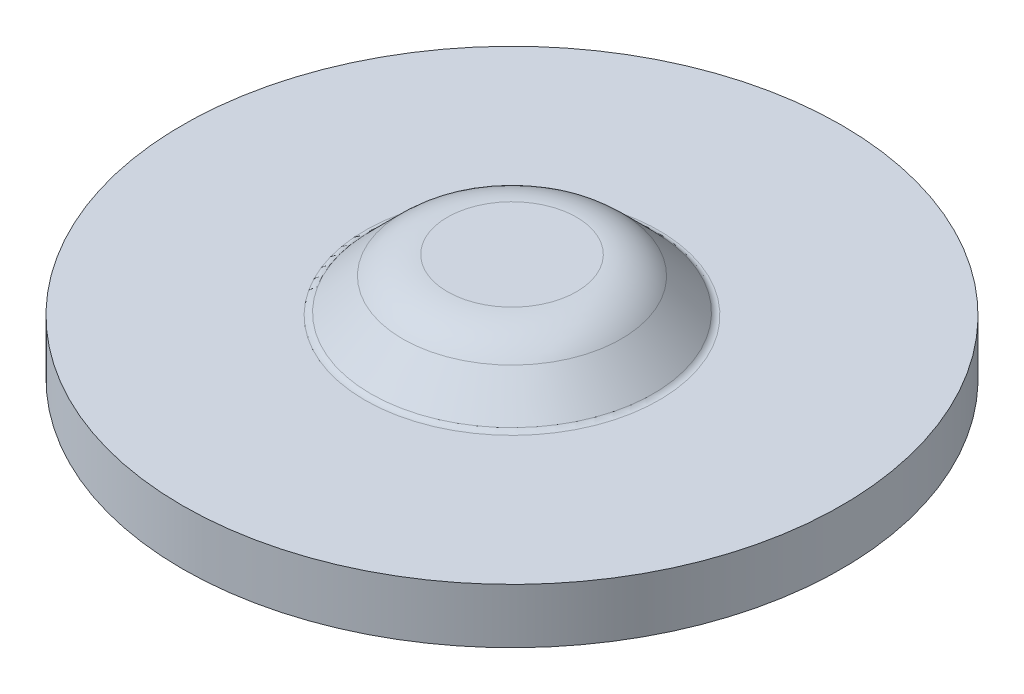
ISO-10303-21;
HEADER;
FILE_DESCRIPTION(('STEP AP214'),'2;1');
FILE_NAME('part.step','',(''),(''),'','','');
FILE_SCHEMA(('AUTOMOTIVE_DESIGN { 1 0 10303 214 1 1 1 1 }'));
ENDSEC;
DATA;
#1=APPLICATION_CONTEXT('core data for automotive mechanical design processes');
#2=APPLICATION_PROTOCOL_DEFINITION('international standard','automotive_design',2000,#1);
#3=PRODUCT_CONTEXT('',#1,'mechanical');
#4=PRODUCT('Part','Part','',(#3));
#5=PRODUCT_RELATED_PRODUCT_CATEGORY('part','',(#4));
#6=PRODUCT_DEFINITION_FORMATION('','',#4);
#7=PRODUCT_DEFINITION_CONTEXT('part definition',#1,'design');
#8=PRODUCT_DEFINITION('design','',#6,#7);
#9=PRODUCT_DEFINITION_SHAPE('','',#8);
#10=(LENGTH_UNIT() NAMED_UNIT(*) SI_UNIT(.MILLI.,.METRE.));
#11=(NAMED_UNIT(*) PLANE_ANGLE_UNIT() SI_UNIT($,.RADIAN.));
#12=(NAMED_UNIT(*) SI_UNIT($,.STERADIAN.) SOLID_ANGLE_UNIT());
#13=UNCERTAINTY_MEASURE_WITH_UNIT(LENGTH_MEASURE(1.E-05),#10,'distance_accuracy_value','');
#14=(GEOMETRIC_REPRESENTATION_CONTEXT(3) GLOBAL_UNCERTAINTY_ASSIGNED_CONTEXT((#13)) GLOBAL_UNIT_ASSIGNED_CONTEXT((#10,
#11,#12)) REPRESENTATION_CONTEXT('',''));
#15=CARTESIAN_POINT('',(0.,0.,0.));
#16=DIRECTION('',(0.,0.,1.));
#17=DIRECTION('',(1.,0.,0.));
#18=AXIS2_PLACEMENT_3D('',#15,#16,#17);
#19=CARTESIAN_POINT('',(0.,0.,0.));
#20=DIRECTION('',(0.,-1.,0.));
#21=DIRECTION('',(0.,0.,-1.));
#22=AXIS2_PLACEMENT_3D('',#19,#20,#21);
#23=PLANE('',#22);
#24=CARTESIAN_POINT('',(0.,0.,0.));
#25=DIRECTION('',(0.,1.,0.));
#26=DIRECTION('',(0.,0.,1.));
#27=AXIS2_PLACEMENT_3D('',#24,#25,#26);
#28=CIRCLE('',#27,3.1115);
#29=CARTESIAN_POINT('',(0.,0.,3.1115));
#30=VERTEX_POINT('',#29);
#31=EDGE_CURVE('E22',#30,#30,#28,.F.);
#32=ORIENTED_EDGE('',*,*,#31,.F.);
#33=EDGE_LOOP('',(#32));
#34=FACE_BOUND('',#33,.T.);
#35=ADVANCED_FACE('F18',(#34),#23,.F.);
#36=CARTESIAN_POINT('',(0.,-3.048,0.));
#37=DIRECTION('',(0.,1.,0.));
#38=DIRECTION('',(0.,0.,1.));
#39=AXIS2_PLACEMENT_3D('',#36,#37,#38);
#40=TOROIDAL_SURFACE('',#39,3.1115,3.048);
#41=CARTESIAN_POINT('',(0.,-0.892738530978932,0.));
#42=DIRECTION('',(0.,-1.,0.));
#43=DIRECTION('',(0.,0.,-1.));
#44=AXIS2_PLACEMENT_3D('',#41,#42,#43);
#45=CIRCLE('',#44,5.26676146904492);
#46=CARTESIAN_POINT('',(0.,-0.892738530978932,-5.26676146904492));
#47=VERTEX_POINT('',#46);
#48=EDGE_CURVE('E39',#47,#47,#45,.T.);
#49=ORIENTED_EDGE('',*,*,#48,.F.);
#50=EDGE_LOOP('',(#49));
#51=FACE_BOUND('',#50,.T.);
#52=ORIENTED_EDGE('',*,*,#31,.T.);
#53=EDGE_LOOP('',(#52));
#54=FACE_BOUND('',#53,.T.);
#55=ADVANCED_FACE('F62',(#51,#54),#40,.T.);
#56=CARTESIAN_POINT('',(0.,-2.6416,0.));
#57=DIRECTION('',(0.,1.,0.));
#58=DIRECTION('',(0.,0.,1.));
#59=AXIS2_PLACEMENT_3D('',#56,#57,#58);
#60=PLANE('',#59);
#61=CARTESIAN_POINT('',(0.,-2.6416,3.1115));
#62=CARTESIAN_POINT('',(0.592973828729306,-2.6416,3.1115));
#63=CARTESIAN_POINT('',(1.14532668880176,-2.6416,2.89303629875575));
#64=CARTESIAN_POINT('',(1.74362217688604,-2.6416,2.65640161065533));
#65=CARTESIAN_POINT('',(2.20016274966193,-2.6416,2.20016274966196));
#66=CARTESIAN_POINT('',(2.65526321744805,-2.6416,1.74536304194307));
#67=CARTESIAN_POINT('',(2.89303629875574,-2.6416,1.14532668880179));
#68=CARTESIAN_POINT('',(3.11130401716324,-2.6416,0.594513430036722));
#69=CARTESIAN_POINT('',(3.1115,-2.6416,0.));
#70=CARTESIAN_POINT('',(3.11169531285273,-2.6416,-0.59248103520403));
#71=CARTESIAN_POINT('',(2.89303629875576,-2.6416,-1.14532668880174));
#72=CARTESIAN_POINT('',(2.65640088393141,-2.6416,-1.74362290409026));
#73=CARTESIAN_POINT('',(2.20016274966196,-2.6416,-2.20016274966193));
#74=CARTESIAN_POINT('',(1.74536304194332,-2.6416,-2.65526321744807));
#75=CARTESIAN_POINT('',(1.14532668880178,-2.6416,-2.89303629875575));
#76=CARTESIAN_POINT('',(0.594018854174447,-2.6416,-3.1115));
#77=CARTESIAN_POINT('',(0.,-2.6416,-3.1115));
#78=B_SPLINE_CURVE_WITH_KNOTS('',2,(#61,#62,#63,#64,#65,#66,#67,#68,#69,#70,#71,#72,#73,#74,#75,
#76,#77),.UNSPECIFIED.,.F.,.F.,(3,2,2,2,2,2,2,2,3),(0.,0.125,0.25,0.375,0.5,0.625,0.75,0.875,
1.),.UNSPECIFIED.);
#79=CARTESIAN_POINT('',(0.,-2.6416,-3.1115));
#80=VERTEX_POINT('',#79);
#81=CARTESIAN_POINT('',(0.,-2.6416,3.1115));
#82=VERTEX_POINT('',#81);
#83=EDGE_CURVE('E34',#80,#82,#78,.F.);
#84=ORIENTED_EDGE('',*,*,#83,.T.);
#85=CARTESIAN_POINT('',(0.,-2.6416,-3.1115));
#86=CARTESIAN_POINT('',(-0.59297382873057,-2.6416,-3.1115));
#87=CARTESIAN_POINT('',(-1.14532668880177,-2.6416,-2.89303629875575));
#88=CARTESIAN_POINT('',(-1.74362217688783,-2.6416,-2.65640161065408));
#89=CARTESIAN_POINT('',(-2.20016274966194,-2.6416,-2.20016274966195));
#90=CARTESIAN_POINT('',(-2.65526321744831,-2.6416,-1.74536304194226));
#91=CARTESIAN_POINT('',(-2.89303629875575,-2.6416,-1.14532668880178));
#92=CARTESIAN_POINT('',(-3.11130401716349,-2.6416,-0.594513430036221));
#93=CARTESIAN_POINT('',(-3.1115,-2.6416,0.));
#94=CARTESIAN_POINT('',(-3.11169531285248,-2.6416,0.59248103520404));
#95=CARTESIAN_POINT('',(-2.89303629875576,-2.6416,1.14532668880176));
#96=CARTESIAN_POINT('',(-2.65640088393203,-2.6416,1.74362290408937));
#97=CARTESIAN_POINT('',(-2.20016274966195,-2.6416,2.20016274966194));
#98=CARTESIAN_POINT('',(-1.7453630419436,-2.6416,2.65526321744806));
#99=CARTESIAN_POINT('',(-1.14532668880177,-2.6416,2.89303629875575));
#100=CARTESIAN_POINT('',(-0.594018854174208,-2.6416,3.1115));
#101=CARTESIAN_POINT('',(0.,-2.6416,3.1115));
#102=B_SPLINE_CURVE_WITH_KNOTS('',2,(#85,#86,#87,#88,#89,#90,#91,#92,#93,#94,#95,#96,#97,#98,
#99,#100,#101),.UNSPECIFIED.,.F.,.F.,(3,2,2,2,2,2,2,2,3),(0.,0.125,0.25,0.375,0.5,0.625,0.75,
0.875,1.),.UNSPECIFIED.);
#103=EDGE_CURVE('E38',#82,#80,#102,.F.);
#104=ORIENTED_EDGE('',*,*,#103,.T.);
#105=EDGE_LOOP('',(#84,#104));
#106=FACE_BOUND('',#105,.T.);
#107=ADVANCED_FACE('F37',(#106),#60,.F.);
#108=CARTESIAN_POINT('',(0.,-2.42096819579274,0.));
#109=DIRECTION('',(0.,-1.,0.));
#110=DIRECTION('',(0.,0.,-1.));
#111=AXIS2_PLACEMENT_3D('',#108,#109,#110);
#112=CONICAL_SURFACE('',#111,6.79499113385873,0.785398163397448);
#113=ORIENTED_EDGE('',*,*,#48,.T.);
#114=EDGE_LOOP('',(#113));
#115=FACE_BOUND('',#114,.T.);
#116=CARTESIAN_POINT('',(0.,-2.42096819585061,0.));
#117=DIRECTION('',(0.,1.,0.));
#118=DIRECTION('',(0.,0.,-1.));
#119=AXIS2_PLACEMENT_3D('',#116,#117,#118);
#120=CIRCLE('',#119,6.7949911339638);
#121=CARTESIAN_POINT('',(0.,-2.42096819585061,-6.7949911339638));
#122=VERTEX_POINT('',#121);
#123=EDGE_CURVE('E43',#122,#122,#120,.T.);
#124=ORIENTED_EDGE('',*,*,#123,.T.);
#125=EDGE_LOOP('',(#124));
#126=FACE_BOUND('',#125,.T.);
#127=ADVANCED_FACE('F61',(#115,#126),#112,.T.);
#128=CARTESIAN_POINT('',(0.,-3.048,0.));
#129=DIRECTION('',(0.,1.,0.));
#130=DIRECTION('',(0.,0.,1.));
#131=AXIS2_PLACEMENT_3D('',#128,#129,#130);
#132=TOROIDAL_SURFACE('',#131,3.1115,0.406400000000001);
#133=ORIENTED_EDGE('',*,*,#103,.F.);
#134=ORIENTED_EDGE('',*,*,#83,.F.);
#135=EDGE_LOOP('',(#133,#134));
#136=FACE_BOUND('',#135,.T.);
#137=CARTESIAN_POINT('',(0.,-2.76063180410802,0.));
#138=DIRECTION('',(0.,-1.,0.));
#139=DIRECTION('',(0.,0.,-1.));
#140=AXIS2_PLACEMENT_3D('',#137,#138,#139);
#141=CIRCLE('',#140,3.39886819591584);
#142=CARTESIAN_POINT('',(0.,-2.76063180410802,-3.39886819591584));
#143=VERTEX_POINT('',#142);
#144=EDGE_CURVE('E46',#143,#143,#141,.T.);
#145=ORIENTED_EDGE('',*,*,#144,.T.);
#146=EDGE_LOOP('',(#145));
#147=FACE_BOUND('',#146,.T.);
#148=ADVANCED_FACE('F41',(#136,#147),#132,.F.);
#149=CARTESIAN_POINT('',(0.,-2.1336,0.));
#150=DIRECTION('',(0.,1.,0.));
#151=DIRECTION('',(0.,0.,1.));
#152=AXIS2_PLACEMENT_3D('',#149,#150,#151);
#153=TOROIDAL_SURFACE('',#152,7.08235932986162,0.406400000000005);
#154=CARTESIAN_POINT('',(0.,-2.54,0.));
#155=DIRECTION('',(0.,1.,0.));
#156=DIRECTION('',(0.,0.,1.));
#157=AXIS2_PLACEMENT_3D('',#154,#155,#156);
#158=CIRCLE('',#157,7.08235932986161);
#159=CARTESIAN_POINT('',(0.,-2.54,7.08235932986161));
#160=VERTEX_POINT('',#159);
#161=EDGE_CURVE('E108',#160,#160,#158,.T.);
#162=ORIENTED_EDGE('',*,*,#161,.T.);
#163=EDGE_LOOP('',(#162));
#164=FACE_BOUND('',#163,.T.);
#165=ORIENTED_EDGE('',*,*,#123,.F.);
#166=EDGE_LOOP('',(#165));
#167=FACE_BOUND('',#166,.T.);
#168=ADVANCED_FACE('F72',(#164,#167),#153,.F.);
#169=CARTESIAN_POINT('',(0.,-4.28886146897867,0.));
#170=DIRECTION('',(0.,-1.,0.));
#171=DIRECTION('',(0.,0.,-1.));
#172=AXIS2_PLACEMENT_3D('',#169,#170,#171);
#173=CONICAL_SURFACE('',#172,4.92709786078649,0.785398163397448);
#174=CARTESIAN_POINT('',(0.,-4.28886146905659,0.));
#175=DIRECTION('',(0.,1.,0.));
#176=DIRECTION('',(0.,0.,-1.));
#177=AXIS2_PLACEMENT_3D('',#174,#175,#176);
#178=CIRCLE('',#177,4.92709786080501);
#179=CARTESIAN_POINT('',(0.,-4.28886146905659,-4.92709786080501));
#180=VERTEX_POINT('',#179);
#181=EDGE_CURVE('E109',#180,#180,#178,.T.);
#182=ORIENTED_EDGE('',*,*,#181,.F.);
#183=EDGE_LOOP('',(#182));
#184=FACE_BOUND('',#183,.T.);
#185=ORIENTED_EDGE('',*,*,#144,.F.);
#186=EDGE_LOOP('',(#185));
#187=FACE_BOUND('',#186,.T.);
#188=ADVANCED_FACE('F74',(#184,#187),#173,.F.);
#189=CARTESIAN_POINT('',(7.08235932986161,-2.54,0.));
#190=DIRECTION('',(0.,-1.,0.));
#191=DIRECTION('',(0.,0.,-1.));
#192=AXIS2_PLACEMENT_3D('',#189,#190,#191);
#193=PLANE('',#192);
#194=CARTESIAN_POINT('',(0.,-2.54,0.));
#195=DIRECTION('',(0.,1.,0.));
#196=DIRECTION('',(0.,0.,1.));
#197=AXIS2_PLACEMENT_3D('',#194,#195,#196);
#198=CIRCLE('',#197,15.875);
#199=CARTESIAN_POINT('',(0.,-2.54,15.875));
#200=VERTEX_POINT('',#199);
#201=EDGE_CURVE('E106',#200,#200,#198,.F.);
#202=ORIENTED_EDGE('',*,*,#201,.F.);
#203=EDGE_LOOP('',(#202));
#204=FACE_BOUND('',#203,.T.);
#205=ORIENTED_EDGE('',*,*,#161,.F.);
#206=EDGE_LOOP('',(#205));
#207=FACE_BOUND('',#206,.T.);
#208=ADVANCED_FACE('F80',(#204,#207),#193,.F.);
#209=CARTESIAN_POINT('',(0.,-2.1336,0.));
#210=DIRECTION('',(0.,1.,0.));
#211=DIRECTION('',(0.,0.,1.));
#212=AXIS2_PLACEMENT_3D('',#209,#210,#211);
#213=TOROIDAL_SURFACE('',#212,7.08235932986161,3.048);
#214=ORIENTED_EDGE('',*,*,#181,.T.);
#215=EDGE_LOOP('',(#214));
#216=FACE_BOUND('',#215,.T.);
#217=CARTESIAN_POINT('',(0.,-5.1816,0.));
#218=DIRECTION('',(0.,1.,0.));
#219=DIRECTION('',(0.,0.,1.));
#220=AXIS2_PLACEMENT_3D('',#217,#218,#219);
#221=CIRCLE('',#220,7.08235932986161);
#222=CARTESIAN_POINT('',(0.,-5.1816,7.08235932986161));
#223=VERTEX_POINT('',#222);
#224=EDGE_CURVE('E28',#223,#223,#221,.F.);
#225=ORIENTED_EDGE('',*,*,#224,.T.);
#226=EDGE_LOOP('',(#225));
#227=FACE_BOUND('',#226,.T.);
#228=ADVANCED_FACE('F20',(#216,#227),#213,.T.);
#229=CARTESIAN_POINT('',(0.,-5.1828539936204,0.));
#230=DIRECTION('',(0.,1.,0.));
#231=DIRECTION('',(0.,0.,1.));
#232=AXIS2_PLACEMENT_3D('',#229,#230,#231);
#233=CYLINDRICAL_SURFACE('',#232,15.875);
#234=ORIENTED_EDGE('',*,*,#201,.T.);
#235=EDGE_LOOP('',(#234));
#236=FACE_BOUND('',#235,.T.);
#237=CARTESIAN_POINT('',(0.,-5.1816,0.));
#238=DIRECTION('',(0.,1.,0.));
#239=DIRECTION('',(0.,0.,1.));
#240=AXIS2_PLACEMENT_3D('',#237,#238,#239);
#241=CIRCLE('',#240,15.875);
#242=CARTESIAN_POINT('',(0.,-5.1816,15.875));
#243=VERTEX_POINT('',#242);
#244=EDGE_CURVE('E11',#243,#243,#241,.T.);
#245=ORIENTED_EDGE('',*,*,#244,.T.);
#246=EDGE_LOOP('',(#245));
#247=FACE_BOUND('',#246,.T.);
#248=ADVANCED_FACE('F86',(#236,#247),#233,.T.);
#249=CARTESIAN_POINT('',(7.08235932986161,-5.1816,0.));
#250=DIRECTION('',(0.,1.,0.));
#251=DIRECTION('',(0.,0.,1.));
#252=AXIS2_PLACEMENT_3D('',#249,#250,#251);
#253=PLANE('',#252);
#254=ORIENTED_EDGE('',*,*,#244,.F.);
#255=EDGE_LOOP('',(#254));
#256=FACE_BOUND('',#255,.T.);
#257=ORIENTED_EDGE('',*,*,#224,.F.);
#258=EDGE_LOOP('',(#257));
#259=FACE_BOUND('',#258,.T.);
#260=ADVANCED_FACE('F84',(#256,#259),#253,.F.);
#261=CLOSED_SHELL('',(#35,#55,#107,#127,#148,#168,#188,#208,#228,#248,#260));
#262=MANIFOLD_SOLID_BREP('B1',#261);
#263=ADVANCED_BREP_SHAPE_REPRESENTATION('',(#18,#262),#14);
#264=SHAPE_DEFINITION_REPRESENTATION(#9,#263);
ENDSEC;
END-ISO-10303-21;
